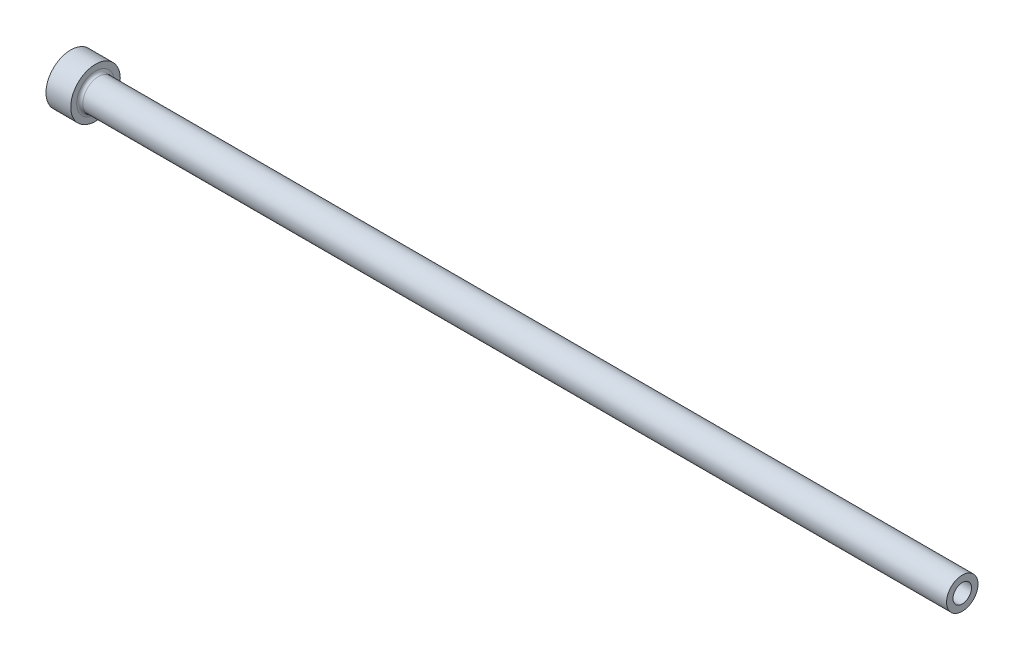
from build123d import *


with BuildPart() as part:
    # Sketch1 → Revolve1 (revolve)
    with BuildSketch(Plane.XY, mode=Mode.PRIVATE) as revolve1_sk:
        with BuildLine():
            Line((-5.1e-08, 5.166360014), (-5.1e-08, 2.580322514))
            Line((-5.1e-08, 2.580322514), (1.190624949, 1.3896975))
            Line((1.190624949, 1.3896975), (170.709421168, 1.3896975))
            Line((170.709421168, 1.3896975), (171.449999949, 1.191260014))
            Line((171.449999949, 1.191260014), (228.599999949, 1.191260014))
            Line((228.599999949, 1.191260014), (228.599999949, 2.848610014))
            Line((228.599999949, 2.848610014), (7.143749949, 2.848610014))
            ThreePointArc((7.143749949, 2.848610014), (6.582483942, 3.081094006), (6.349999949, 3.642360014))
            Line((6.349999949, 3.642360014), (6.349999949, 5.166360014))
            Line((6.349999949, 5.166360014), (-5.1e-08, 5.166360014))
        make_face()
    revolve(revolve1_sk.sketch.rotate(Axis((228.599999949, -1.183639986, 0), (-1, 0, 0)), 180), axis=Axis((228.599999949, -1.183639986, 0), (-1, 0, 0)))


solid = part.part
